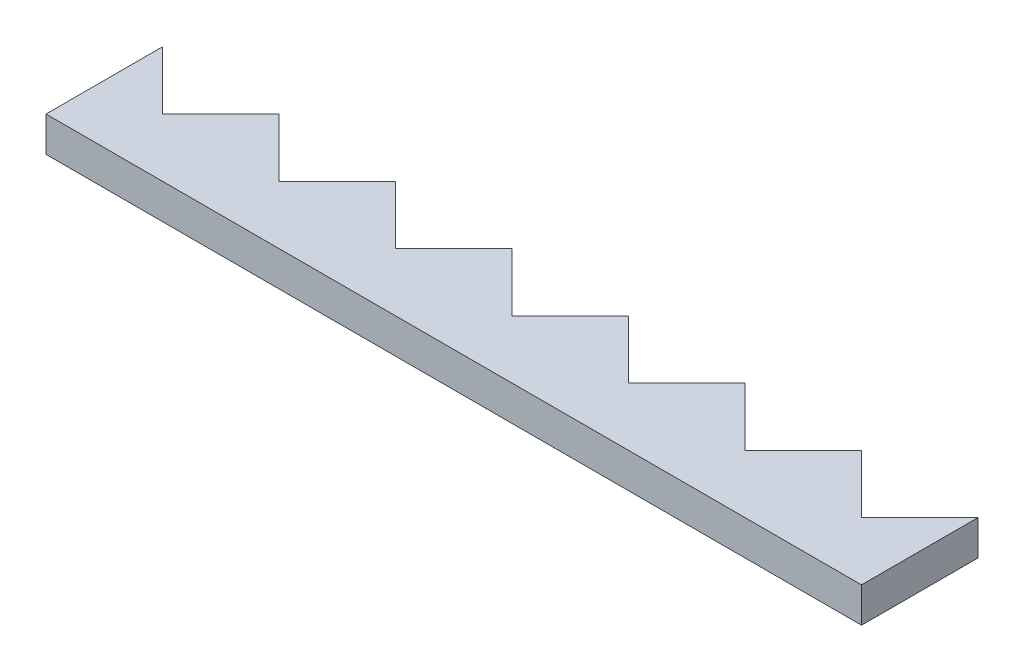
from build123d import *

# Parameters (mm, degrees)
BOSS_EXTRUDE1_DEPTH = 3


with BuildPart() as part:
    # Sketch1 → Boss-Extrude1 (new body)
    with BuildSketch(Plane(origin=(0, 3, 0), x_dir=(1, 0, 0), z_dir=(0, 1, 0))):
        Polygon((0, 0), (0, 10), (5, 5), (10, 10), (15, 5), (20, 10), (25, 5), (30, 10), (35, 5), (40, 10), (45, 5), (50, 10), (55, 5), (60, 10), (65, 5), (70, 10), (70, 0), align=None)
    extrude(amount=BOSS_EXTRUDE1_DEPTH)


solid = part.part
